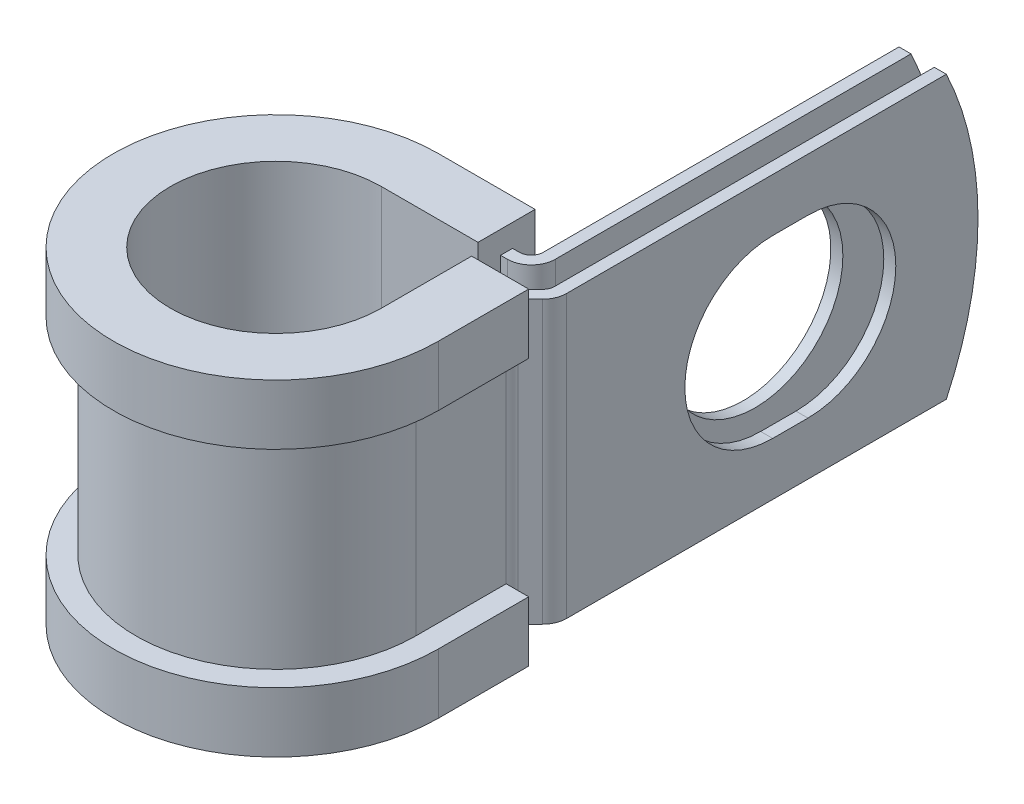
from build123d import *

# Parameters (mm, degrees)
EXTRUDE_THIN1_DEPTH = 9.525
SKETCH2_R           = 5.9436
CUT_EXTRUDE1_DEPTH  = 0.8128
CUT_EXTRUDE2_DEPTH  = 0.8128
CUT_EXTRUDE3_DEPTH  = 42.495167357


with BuildPart() as part:
    # Sketch1 → Extrude-Thin1 (new, symmetric)
    with BuildSketch(Plane(origin=(0, 0, 0), x_dir=(1, 0, 0), z_dir=(0, 1, 0))):
        with BuildLine():
            Line((10.201774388, 36.4998), (10.201774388, 8.6614))
            ThreePointArc((10.201774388, 8.6614), (10.139903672, 8.350354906), (9.96371078, 8.086663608))
            Line((9.96371078, 8.086663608), (9.137527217, 7.260480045))
            ThreePointArc((9.137527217, 7.260480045), (8.785141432, 6.733097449), (8.6614, 6.111007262))
            Line((8.6614, 6.111007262), (8.6614, 0))
            ThreePointArc((8.6614, 0), (-6.124534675, -6.124534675), (0, 8.6614))
            Line((0, 8.6614), (7.001374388, 8.6614))
            ThreePointArc((7.001374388, 8.6614), (8.150847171, 9.137527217), (8.626974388, 10.287))
            Line((8.626974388, 10.287), (8.626974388, 36.4998))
            Line((8.626974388, 36.4998), (7.814174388, 36.4998))
            Line((7.814174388, 36.4998), (7.814174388, 10.287))
            ThreePointArc((7.814174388, 10.287), (7.57611078, 9.712263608), (7.001374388, 9.4742))
            Line((7.001374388, 9.4742), (0, 9.4742))
            ThreePointArc((0, 9.4742), (-6.699271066, -6.699271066), (9.4742, 0))
            Line((9.4742, 0), (9.4742, 6.111007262))
            ThreePointArc((9.4742, 6.111007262), (9.536070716, 6.422052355), (9.712263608, 6.685743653))
            Line((9.712263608, 6.685743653), (10.538447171, 7.511927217))
            ThreePointArc((10.538447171, 7.511927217), (10.890832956, 8.039309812), (11.014574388, 8.6614))
            Line((11.014574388, 8.6614), (11.014574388, 36.4998))
            Line((11.014574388, 36.4998), (10.201774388, 36.4998))
        make_face()
    extrude(amount=EXTRUDE_THIN1_DEPTH, both=True)

    # Sketch2 → Cut-Extrude1 (cut)
    with BuildSketch(Plane.ZY.offset(-7.814174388)):
        with Locations((-23.7998, 0)):
            Circle(SKETCH2_R)
    extrude(amount=-CUT_EXTRUDE1_DEPTH, mode=Mode.SUBTRACT)

    # Sketch3 → Cut-Extrude2 (cut)
    with BuildSketch(Plane(origin=(11.014574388, 0, 0), x_dir=(0, 0, -1), z_dir=(1, 0, 0))):
        with BuildLine():
            Line((22.606, 5.9436), (24.9936, 5.9436))
            ThreePointArc((24.9936, 5.9436), (30.9372, 0), (24.9936, -5.9436))
            Line((24.9936, -5.9436), (22.606, -5.9436))
            ThreePointArc((22.606, -5.9436), (16.6624, 0), (22.606, 5.9436))
        make_face()
    extrude(amount=-CUT_EXTRUDE2_DEPTH, mode=Mode.SUBTRACT)

    # Sketch4 → Cut-Extrude3 (cut, through all)
    with BuildSketch(Plane.ZY.offset(-7.814174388)):
        with BuildLine():
            Line((-34.355263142, 9.525), (-36.4998, 9.525))
            Line((-36.4998, 9.525), (-36.4998, 0))
            ThreePointArc((-36.4998, 0), (-35.957038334, 4.881717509), (-34.355263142, 9.525))
        make_face()
        with BuildLine():
            ThreePointArc((-34.355263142, -9.525), (-35.957038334, -4.881717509), (-36.4998, 0))
            Line((-36.4998, 0), (-36.4998, -9.525))
            Line((-36.4998, -9.525), (-34.355263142, -9.525))
        make_face()
    extrude(amount=-CUT_EXTRUDE3_DEPTH, mode=Mode.SUBTRACT)

    # Sweep1: sweep along a path in Sketch6
    with BuildLine(Plane(origin=(0, 9.525, 0), x_dir=(1, 0, 0), z_dir=(0, 1, 0))) as sweep1_path:
        Line((7.1374, 6.111007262), (7.1374, 0))
        ThreePointArc((7.1374, 0), (-5.04690394, -5.04690394), (0, 7.1374))
        Line((0, 7.1374), (6.544174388, 7.1374))
    # Sketch5 → Sweep1 (sweep)
    with BuildSketch(Plane(origin=(0, 0, -6.111007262), x_dir=(-1, 0, 0), z_dir=(0, 0, -1))):
        Polygon((-9.4742, 9.525), (-8.6614, 9.525), (-8.6614, -9.525), (-9.4742, -9.525), (-9.4742, -6.985), (-10.9982, -6.985), (-10.9982, -11.049), (-7.1374, -11.049), (-7.1374, 11.049), (-10.9982, 11.049), (-10.9982, 6.985), (-9.4742, 6.985), align=None)
    sweep(path=sweep1_path.line)


solid = part.part
